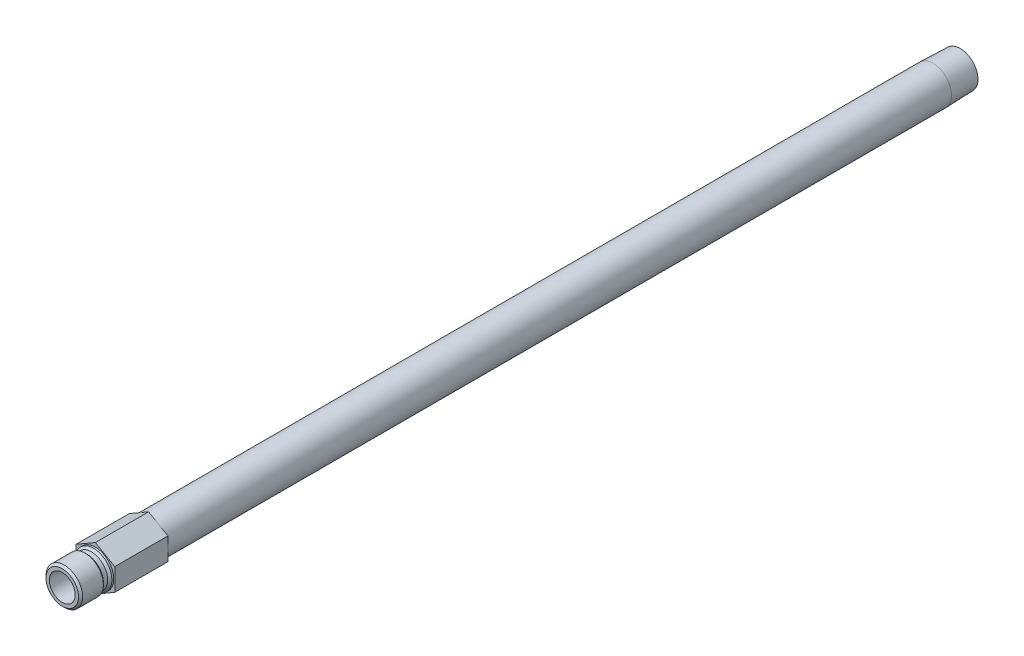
ISO-10303-21;
HEADER;
FILE_DESCRIPTION(('STEP AP214'),'2;1');
FILE_NAME('part.step','',(''),(''),'','','');
FILE_SCHEMA(('AUTOMOTIVE_DESIGN { 1 0 10303 214 1 1 1 1 }'));
ENDSEC;
DATA;
#1=APPLICATION_CONTEXT('core data for automotive mechanical design processes');
#2=APPLICATION_PROTOCOL_DEFINITION('international standard','automotive_design',2000,#1);
#3=PRODUCT_CONTEXT('',#1,'mechanical');
#4=PRODUCT('Part','Part','',(#3));
#5=PRODUCT_RELATED_PRODUCT_CATEGORY('part','',(#4));
#6=PRODUCT_DEFINITION_FORMATION('','',#4);
#7=PRODUCT_DEFINITION_CONTEXT('part definition',#1,'design');
#8=PRODUCT_DEFINITION('design','',#6,#7);
#9=PRODUCT_DEFINITION_SHAPE('','',#8);
#10=(LENGTH_UNIT() NAMED_UNIT(*) SI_UNIT(.MILLI.,.METRE.));
#11=(NAMED_UNIT(*) PLANE_ANGLE_UNIT() SI_UNIT($,.RADIAN.));
#12=(NAMED_UNIT(*) SI_UNIT($,.STERADIAN.) SOLID_ANGLE_UNIT());
#13=UNCERTAINTY_MEASURE_WITH_UNIT(LENGTH_MEASURE(1.E-05),#10,'distance_accuracy_value','');
#14=(GEOMETRIC_REPRESENTATION_CONTEXT(3) GLOBAL_UNCERTAINTY_ASSIGNED_CONTEXT((#13)) GLOBAL_UNIT_ASSIGNED_CONTEXT((#10,
#11,#12)) REPRESENTATION_CONTEXT('',''));
#15=CARTESIAN_POINT('',(0.,0.,0.));
#16=DIRECTION('',(0.,0.,1.));
#17=DIRECTION('',(1.,0.,0.));
#18=AXIS2_PLACEMENT_3D('',#15,#16,#17);
#19=CARTESIAN_POINT('',(0.,0.,0.));
#20=DIRECTION('',(0.,0.,-1.));
#21=DIRECTION('',(0.,1.,0.));
#22=AXIS2_PLACEMENT_3D('',#19,#20,#21);
#23=CYLINDRICAL_SURFACE('',#22,4.7625);
#24=CARTESIAN_POINT('',(0.,0.,0.));
#25=DIRECTION('',(0.,0.,1.));
#26=DIRECTION('',(1.,0.,0.));
#27=AXIS2_PLACEMENT_3D('',#24,#25,#26);
#28=CIRCLE('',#27,4.7625);
#29=CARTESIAN_POINT('',(4.7625,0.,0.));
#30=VERTEX_POINT('',#29);
#31=EDGE_CURVE('E138',#30,#30,#28,.T.);
#32=ORIENTED_EDGE('',*,*,#31,.F.);
#33=EDGE_LOOP('',(#32));
#34=FACE_BOUND('',#33,.T.);
#35=CARTESIAN_POINT('',(0.,0.,12.192));
#36=DIRECTION('',(0.,0.,-1.));
#37=DIRECTION('',(0.,1.,0.));
#38=AXIS2_PLACEMENT_3D('',#35,#36,#37);
#39=CIRCLE('',#38,4.7625);
#40=CARTESIAN_POINT('',(0.,4.7625,12.192));
#41=VERTEX_POINT('',#40);
#42=EDGE_CURVE('E11',#41,#41,#39,.T.);
#43=ORIENTED_EDGE('',*,*,#42,.F.);
#44=EDGE_LOOP('',(#43));
#45=FACE_BOUND('',#44,.T.);
#46=ADVANCED_FACE('F33',(#34,#45),#23,.F.);
#47=CARTESIAN_POINT('',(0.,4.7625,12.192));
#48=DIRECTION('',(0.,0.,1.));
#49=DIRECTION('',(0.,-1.,0.));
#50=AXIS2_PLACEMENT_3D('',#47,#48,#49);
#51=PLANE('',#50);
#52=ORIENTED_EDGE('',*,*,#42,.T.);
#53=EDGE_LOOP('',(#52));
#54=FACE_BOUND('',#53,.T.);
#55=CARTESIAN_POINT('',(0.,0.,12.192));
#56=DIRECTION('',(0.,0.,-1.));
#57=DIRECTION('',(0.,1.,0.));
#58=AXIS2_PLACEMENT_3D('',#55,#56,#57);
#59=CIRCLE('',#58,5.9817);
#60=CARTESIAN_POINT('',(0.,5.9817,12.192));
#61=VERTEX_POINT('',#60);
#62=EDGE_CURVE('E41',#61,#61,#59,.T.);
#63=ORIENTED_EDGE('',*,*,#62,.F.);
#64=EDGE_LOOP('',(#63));
#65=FACE_BOUND('',#64,.T.);
#66=ADVANCED_FACE('F181',(#54,#65),#51,.T.);
#67=CARTESIAN_POINT('',(0.,0.,11.43));
#68=DIRECTION('',(0.,0.,-1.));
#69=DIRECTION('',(0.,1.,0.));
#70=AXIS2_PLACEMENT_3D('',#67,#68,#69);
#71=CONICAL_SURFACE('',#70,6.7437,0.785398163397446);
#72=ORIENTED_EDGE('',*,*,#62,.T.);
#73=EDGE_LOOP('',(#72));
#74=FACE_BOUND('',#73,.T.);
#75=CARTESIAN_POINT('',(0.,0.,11.43));
#76=DIRECTION('',(0.,0.,-1.));
#77=DIRECTION('',(0.,1.,0.));
#78=AXIS2_PLACEMENT_3D('',#75,#76,#77);
#79=CIRCLE('',#78,6.7437);
#80=CARTESIAN_POINT('',(0.,6.7437,11.43));
#81=VERTEX_POINT('',#80);
#82=EDGE_CURVE('E173',#81,#81,#79,.T.);
#83=ORIENTED_EDGE('',*,*,#82,.F.);
#84=EDGE_LOOP('',(#83));
#85=FACE_BOUND('',#84,.T.);
#86=ADVANCED_FACE('F178',(#74,#85),#71,.T.);
#87=CARTESIAN_POINT('',(0.,0.,0.));
#88=DIRECTION('',(0.,0.,-1.));
#89=DIRECTION('',(0.,1.,0.));
#90=AXIS2_PLACEMENT_3D('',#87,#88,#89);
#91=CYLINDRICAL_SURFACE('',#90,6.7437);
#92=ORIENTED_EDGE('',*,*,#82,.T.);
#93=EDGE_LOOP('',(#92));
#94=FACE_BOUND('',#93,.T.);
#95=CARTESIAN_POINT('',(0.,0.,3.81));
#96=DIRECTION('',(0.,0.,-1.));
#97=DIRECTION('',(0.,1.,0.));
#98=AXIS2_PLACEMENT_3D('',#95,#96,#97);
#99=CIRCLE('',#98,6.7437);
#100=CARTESIAN_POINT('',(0.,6.7437,3.81));
#101=VERTEX_POINT('',#100);
#102=EDGE_CURVE('E170',#101,#101,#99,.T.);
#103=ORIENTED_EDGE('',*,*,#102,.F.);
#104=EDGE_LOOP('',(#103));
#105=FACE_BOUND('',#104,.T.);
#106=ADVANCED_FACE('F188',(#94,#105),#91,.T.);
#107=CARTESIAN_POINT('',(0.,0.,3.048));
#108=DIRECTION('',(0.,0.,1.));
#109=DIRECTION('',(0.,-1.,0.));
#110=AXIS2_PLACEMENT_3D('',#107,#108,#109);
#111=CONICAL_SURFACE('',#110,5.9817,0.785398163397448);
#112=ORIENTED_EDGE('',*,*,#102,.T.);
#113=EDGE_LOOP('',(#112));
#114=FACE_BOUND('',#113,.T.);
#115=CARTESIAN_POINT('',(0.,0.,3.048));
#116=DIRECTION('',(0.,0.,-1.));
#117=DIRECTION('',(0.,1.,0.));
#118=AXIS2_PLACEMENT_3D('',#115,#116,#117);
#119=CIRCLE('',#118,5.9817);
#120=CARTESIAN_POINT('',(0.,5.9817,3.048));
#121=VERTEX_POINT('',#120);
#122=EDGE_CURVE('E167',#121,#121,#119,.T.);
#123=ORIENTED_EDGE('',*,*,#122,.F.);
#124=EDGE_LOOP('',(#123));
#125=FACE_BOUND('',#124,.T.);
#126=ADVANCED_FACE('F194',(#114,#125),#111,.T.);
#127=CARTESIAN_POINT('',(0.,0.,0.));
#128=DIRECTION('',(0.,0.,-1.));
#129=DIRECTION('',(0.,1.,0.));
#130=AXIS2_PLACEMENT_3D('',#127,#128,#129);
#131=CYLINDRICAL_SURFACE('',#130,5.9817);
#132=ORIENTED_EDGE('',*,*,#122,.T.);
#133=EDGE_LOOP('',(#132));
#134=FACE_BOUND('',#133,.T.);
#135=CARTESIAN_POINT('',(0.,0.,1.4605));
#136=DIRECTION('',(0.,0.,-1.));
#137=DIRECTION('',(0.,1.,0.));
#138=AXIS2_PLACEMENT_3D('',#135,#136,#137);
#139=CIRCLE('',#138,5.9817);
#140=CARTESIAN_POINT('',(0.,5.9817,1.4605));
#141=VERTEX_POINT('',#140);
#142=EDGE_CURVE('E164',#141,#141,#139,.T.);
#143=ORIENTED_EDGE('',*,*,#142,.F.);
#144=EDGE_LOOP('',(#143));
#145=FACE_BOUND('',#144,.T.);
#146=ADVANCED_FACE('F198',(#134,#145),#131,.T.);
#147=CARTESIAN_POINT('',(0.,0.,0.698499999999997));
#148=DIRECTION('',(0.,0.,-1.));
#149=DIRECTION('',(0.,1.,0.));
#150=AXIS2_PLACEMENT_3D('',#147,#148,#149);
#151=CONICAL_SURFACE('',#150,6.7437,0.785398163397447);
#152=ORIENTED_EDGE('',*,*,#142,.T.);
#153=EDGE_LOOP('',(#152));
#154=FACE_BOUND('',#153,.T.);
#155=CARTESIAN_POINT('',(0.,0.,0.698499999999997));
#156=DIRECTION('',(0.,0.,-1.));
#157=DIRECTION('',(0.,1.,0.));
#158=AXIS2_PLACEMENT_3D('',#155,#156,#157);
#159=CIRCLE('',#158,6.7437);
#160=CARTESIAN_POINT('',(0.,6.7437,0.698499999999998));
#161=VERTEX_POINT('',#160);
#162=EDGE_CURVE('E161',#161,#161,#159,.T.);
#163=ORIENTED_EDGE('',*,*,#162,.F.);
#164=EDGE_LOOP('',(#163));
#165=FACE_BOUND('',#164,.T.);
#166=ADVANCED_FACE('F202',(#154,#165),#151,.T.);
#167=CARTESIAN_POINT('',(0.,0.,0.));
#168=DIRECTION('',(0.,0.,-1.));
#169=DIRECTION('',(0.,1.,0.));
#170=AXIS2_PLACEMENT_3D('',#167,#168,#169);
#171=CYLINDRICAL_SURFACE('',#170,6.7437);
#172=ORIENTED_EDGE('',*,*,#162,.T.);
#173=EDGE_LOOP('',(#172));
#174=FACE_BOUND('',#173,.T.);
#175=CARTESIAN_POINT('',(0.,0.,0.));
#176=DIRECTION('',(0.,0.,-1.));
#177=DIRECTION('',(0.,1.,0.));
#178=AXIS2_PLACEMENT_3D('',#175,#176,#177);
#179=CIRCLE('',#178,6.7437);
#180=CARTESIAN_POINT('',(0.,6.7437,0.));
#181=VERTEX_POINT('',#180);
#182=EDGE_CURVE('E158',#181,#181,#179,.T.);
#183=ORIENTED_EDGE('',*,*,#182,.F.);
#184=EDGE_LOOP('',(#183));
#185=FACE_BOUND('',#184,.T.);
#186=ADVANCED_FACE('F206',(#174,#185),#171,.T.);
#187=CARTESIAN_POINT('',(0.,6.7437,0.));
#188=DIRECTION('',(0.,0.,1.));
#189=DIRECTION('',(0.,-1.,0.));
#190=AXIS2_PLACEMENT_3D('',#187,#188,#189);
#191=PLANE('',#190);
#192=ORIENTED_EDGE('',*,*,#182,.T.);
#193=EDGE_LOOP('',(#192));
#194=FACE_BOUND('',#193,.T.);
#195=DIRECTION('',(-0.866025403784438,-0.5,0.));
#196=VECTOR('',#195,1.);
#197=CARTESIAN_POINT('',(0.,8.21223022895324,0.));
#198=LINE('',#197,#196);
#199=CARTESIAN_POINT('',(0.,8.21223022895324,0.));
#200=VERTEX_POINT('',#199);
#201=CARTESIAN_POINT('',(-7.112,4.10611511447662,0.));
#202=VERTEX_POINT('',#201);
#203=EDGE_CURVE('E120',#200,#202,#198,.T.);
#204=ORIENTED_EDGE('',*,*,#203,.T.);
#205=DIRECTION('',(0.,-1.,0.));
#206=VECTOR('',#205,1.);
#207=CARTESIAN_POINT('',(-7.112,4.10611511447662,0.));
#208=LINE('',#207,#206);
#209=CARTESIAN_POINT('',(-7.112,-4.10611511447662,0.));
#210=VERTEX_POINT('',#209);
#211=EDGE_CURVE('E123',#202,#210,#208,.T.);
#212=ORIENTED_EDGE('',*,*,#211,.T.);
#213=DIRECTION('',(0.866025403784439,-0.5,0.));
#214=VECTOR('',#213,1.);
#215=CARTESIAN_POINT('',(-7.112,-4.10611511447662,0.));
#216=LINE('',#215,#214);
#217=CARTESIAN_POINT('',(0.,-8.21223022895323,0.));
#218=VERTEX_POINT('',#217);
#219=EDGE_CURVE('E127',#210,#218,#216,.T.);
#220=ORIENTED_EDGE('',*,*,#219,.T.);
#221=DIRECTION('',(0.866025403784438,0.5,0.));
#222=VECTOR('',#221,1.);
#223=CARTESIAN_POINT('',(0.,-8.21223022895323,0.));
#224=LINE('',#223,#222);
#225=CARTESIAN_POINT('',(7.112,-4.10611511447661,0.));
#226=VERTEX_POINT('',#225);
#227=EDGE_CURVE('E130',#218,#226,#224,.T.);
#228=ORIENTED_EDGE('',*,*,#227,.T.);
#229=DIRECTION('',(0.,1.,0.));
#230=VECTOR('',#229,1.);
#231=CARTESIAN_POINT('',(7.112,-4.10611511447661,0.));
#232=LINE('',#231,#230);
#233=CARTESIAN_POINT('',(7.112,4.10611511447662,0.));
#234=VERTEX_POINT('',#233);
#235=EDGE_CURVE('E97',#226,#234,#232,.T.);
#236=ORIENTED_EDGE('',*,*,#235,.T.);
#237=DIRECTION('',(-0.866025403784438,0.5,0.));
#238=VECTOR('',#237,1.);
#239=CARTESIAN_POINT('',(7.112,4.10611511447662,0.));
#240=LINE('',#239,#238);
#241=EDGE_CURVE('E133',#234,#200,#240,.T.);
#242=ORIENTED_EDGE('',*,*,#241,.T.);
#243=EDGE_LOOP('',(#204,#212,#220,#228,#236,#242));
#244=FACE_BOUND('',#243,.T.);
#245=ADVANCED_FACE('F210',(#194,#244),#191,.T.);
#246=CARTESIAN_POINT('',(-7.112,4.10611511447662,0.));
#247=DIRECTION('',(0.,0.,1.));
#248=DIRECTION('',(1.,0.,0.));
#249=AXIS2_PLACEMENT_3D('',#246,#247,#248);
#250=PLANE('',#249);
#251=ORIENTED_EDGE('',*,*,#31,.T.);
#252=EDGE_LOOP('',(#251));
#253=FACE_BOUND('',#252,.T.);
#254=CARTESIAN_POINT('',(0.,0.,0.));
#255=DIRECTION('',(0.,0.,1.));
#256=DIRECTION('',(1.,0.,0.));
#257=AXIS2_PLACEMENT_3D('',#254,#255,#256);
#258=CIRCLE('',#257,4.62279999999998);
#259=CARTESIAN_POINT('',(4.62279999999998,0.,0.));
#260=VERTEX_POINT('',#259);
#261=EDGE_CURVE('E124',#260,#260,#258,.T.);
#262=ORIENTED_EDGE('',*,*,#261,.F.);
#263=EDGE_LOOP('',(#262));
#264=FACE_BOUND('',#263,.T.);
#265=ADVANCED_FACE('F214',(#253,#264),#250,.T.);
#266=CARTESIAN_POINT('',(0.,0.,-318.008));
#267=DIRECTION('',(0.,0.,1.));
#268=DIRECTION('',(0.,-1.,0.));
#269=AXIS2_PLACEMENT_3D('',#266,#267,#268);
#270=CONICAL_SURFACE('',#269,6.54447060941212,0.0312396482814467);
#271=CARTESIAN_POINT('',(0.,0.,-307.975));
#272=DIRECTION('',(0.,0.,-1.));
#273=DIRECTION('',(0.,1.,0.));
#274=AXIS2_PLACEMENT_3D('',#271,#272,#273);
#275=CIRCLE('',#274,6.85799999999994);
#276=CARTESIAN_POINT('',(0.,6.858,-307.975));
#277=VERTEX_POINT('',#276);
#278=EDGE_CURVE('E155',#277,#277,#275,.T.);
#279=ORIENTED_EDGE('',*,*,#278,.T.);
#280=EDGE_LOOP('',(#279));
#281=FACE_BOUND('',#280,.T.);
#282=CARTESIAN_POINT('',(0.,0.,-318.008));
#283=DIRECTION('',(0.,0.,-1.));
#284=DIRECTION('',(0.,1.,0.));
#285=AXIS2_PLACEMENT_3D('',#282,#283,#284);
#286=CIRCLE('',#285,6.54447060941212);
#287=CARTESIAN_POINT('',(0.,6.54447060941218,-318.008));
#288=VERTEX_POINT('',#287);
#289=EDGE_CURVE('E152',#288,#288,#286,.T.);
#290=ORIENTED_EDGE('',*,*,#289,.F.);
#291=EDGE_LOOP('',(#290));
#292=FACE_BOUND('',#291,.T.);
#293=ADVANCED_FACE('F220',(#281,#292),#270,.T.);
#294=CARTESIAN_POINT('',(0.,0.,0.));
#295=DIRECTION('',(0.,0.,-1.));
#296=DIRECTION('',(0.,1.,0.));
#297=AXIS2_PLACEMENT_3D('',#294,#295,#296);
#298=CYLINDRICAL_SURFACE('',#297,6.85799999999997);
#299=ORIENTED_EDGE('',*,*,#278,.F.);
#300=EDGE_LOOP('',(#299));
#301=FACE_BOUND('',#300,.T.);
#302=CARTESIAN_POINT('',(0.,0.,-19.558));
#303=DIRECTION('',(0.,0.,1.));
#304=DIRECTION('',(1.,0.,0.));
#305=AXIS2_PLACEMENT_3D('',#302,#303,#304);
#306=CIRCLE('',#305,6.85799999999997);
#307=CARTESIAN_POINT('',(6.85799999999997,0.,-19.558));
#308=VERTEX_POINT('',#307);
#309=EDGE_CURVE('E146',#308,#308,#306,.F.);
#310=ORIENTED_EDGE('',*,*,#309,.T.);
#311=EDGE_LOOP('',(#310));
#312=FACE_BOUND('',#311,.T.);
#313=ADVANCED_FACE('F216',(#301,#312),#298,.T.);
#314=CARTESIAN_POINT('',(0.,6.54447060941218,-318.008));
#315=DIRECTION('',(0.,0.,-1.));
#316=DIRECTION('',(0.,1.,0.));
#317=AXIS2_PLACEMENT_3D('',#314,#315,#316);
#318=PLANE('',#317);
#319=ORIENTED_EDGE('',*,*,#289,.T.);
#320=EDGE_LOOP('',(#319));
#321=FACE_BOUND('',#320,.T.);
#322=CARTESIAN_POINT('',(0.,0.,-318.008));
#323=DIRECTION('',(0.,0.,-1.));
#324=DIRECTION('',(0.,1.,0.));
#325=AXIS2_PLACEMENT_3D('',#322,#323,#324);
#326=CIRCLE('',#325,4.62279999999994);
#327=CARTESIAN_POINT('',(0.,4.6228,-318.008));
#328=VERTEX_POINT('',#327);
#329=EDGE_CURVE('E149',#328,#328,#326,.T.);
#330=ORIENTED_EDGE('',*,*,#329,.F.);
#331=EDGE_LOOP('',(#330));
#332=FACE_BOUND('',#331,.T.);
#333=ADVANCED_FACE('F219',(#321,#332),#318,.T.);
#334=CARTESIAN_POINT('',(0.,0.,0.));
#335=DIRECTION('',(0.,0.,-1.));
#336=DIRECTION('',(0.,1.,0.));
#337=AXIS2_PLACEMENT_3D('',#334,#335,#336);
#338=CYLINDRICAL_SURFACE('',#337,4.62279999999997);
#339=ORIENTED_EDGE('',*,*,#261,.T.);
#340=EDGE_LOOP('',(#339));
#341=FACE_BOUND('',#340,.T.);
#342=ORIENTED_EDGE('',*,*,#329,.T.);
#343=EDGE_LOOP('',(#342));
#344=FACE_BOUND('',#343,.T.);
#345=ADVANCED_FACE('F227',(#341,#344),#338,.F.);
#346=CARTESIAN_POINT('',(0.,8.21223022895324,-19.558));
#347=DIRECTION('',(-0.5,0.866025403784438,0.));
#348=DIRECTION('',(-0.866025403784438,-0.5,0.));
#349=AXIS2_PLACEMENT_3D('',#346,#347,#348);
#350=PLANE('',#349);
#351=ORIENTED_EDGE('',*,*,#203,.F.);
#352=DIRECTION('',(0.,0.,1.));
#353=VECTOR('',#352,1.);
#354=CARTESIAN_POINT('',(0.,8.21223022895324,-19.558));
#355=LINE('',#354,#353);
#356=CARTESIAN_POINT('',(0.,8.21223022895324,-19.558));
#357=VERTEX_POINT('',#356);
#358=EDGE_CURVE('E49',#357,#200,#355,.T.);
#359=ORIENTED_EDGE('',*,*,#358,.F.);
#360=DIRECTION('',(-0.866025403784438,-0.5,0.));
#361=VECTOR('',#360,1.);
#362=CARTESIAN_POINT('',(0.,8.21223022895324,-19.558));
#363=LINE('',#362,#361);
#364=CARTESIAN_POINT('',(-7.112,4.10611511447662,-19.558));
#365=VERTEX_POINT('',#364);
#366=EDGE_CURVE('E136',#357,#365,#363,.T.);
#367=ORIENTED_EDGE('',*,*,#366,.T.);
#368=DIRECTION('',(0.,0.,1.));
#369=VECTOR('',#368,1.);
#370=CARTESIAN_POINT('',(-7.112,4.10611511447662,-19.558));
#371=LINE('',#370,#369);
#372=EDGE_CURVE('E84',#365,#202,#371,.T.);
#373=ORIENTED_EDGE('',*,*,#372,.T.);
#374=EDGE_LOOP('',(#351,#359,#367,#373));
#375=FACE_BOUND('',#374,.T.);
#376=ADVANCED_FACE('F231',(#375),#350,.T.);
#377=CARTESIAN_POINT('',(7.112,4.10611511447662,-19.558));
#378=DIRECTION('',(0.5,0.866025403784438,0.));
#379=DIRECTION('',(-0.866025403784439,0.5,0.));
#380=AXIS2_PLACEMENT_3D('',#377,#378,#379);
#381=PLANE('',#380);
#382=ORIENTED_EDGE('',*,*,#241,.F.);
#383=DIRECTION('',(0.,0.,1.));
#384=VECTOR('',#383,1.);
#385=CARTESIAN_POINT('',(7.112,4.10611511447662,-19.558));
#386=LINE('',#385,#384);
#387=CARTESIAN_POINT('',(7.112,4.10611511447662,-19.558));
#388=VERTEX_POINT('',#387);
#389=EDGE_CURVE('E72',#388,#234,#386,.T.);
#390=ORIENTED_EDGE('',*,*,#389,.F.);
#391=DIRECTION('',(-0.866025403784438,0.5,0.));
#392=VECTOR('',#391,1.);
#393=CARTESIAN_POINT('',(7.112,4.10611511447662,-19.558));
#394=LINE('',#393,#392);
#395=EDGE_CURVE('E110',#388,#357,#394,.T.);
#396=ORIENTED_EDGE('',*,*,#395,.T.);
#397=ORIENTED_EDGE('',*,*,#358,.T.);
#398=EDGE_LOOP('',(#382,#390,#396,#397));
#399=FACE_BOUND('',#398,.T.);
#400=ADVANCED_FACE('F235',(#399),#381,.T.);
#401=CARTESIAN_POINT('',(7.112,-4.10611511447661,-19.558));
#402=DIRECTION('',(1.,0.,0.));
#403=DIRECTION('',(0.,1.,0.));
#404=AXIS2_PLACEMENT_3D('',#401,#402,#403);
#405=PLANE('',#404);
#406=ORIENTED_EDGE('',*,*,#235,.F.);
#407=DIRECTION('',(0.,0.,1.));
#408=VECTOR('',#407,1.);
#409=CARTESIAN_POINT('',(7.112,-4.10611511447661,-19.558));
#410=LINE('',#409,#408);
#411=CARTESIAN_POINT('',(7.112,-4.10611511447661,-19.558));
#412=VERTEX_POINT('',#411);
#413=EDGE_CURVE('E92',#412,#226,#410,.T.);
#414=ORIENTED_EDGE('',*,*,#413,.F.);
#415=DIRECTION('',(0.,1.,0.));
#416=VECTOR('',#415,1.);
#417=CARTESIAN_POINT('',(7.112,-4.10611511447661,-19.558));
#418=LINE('',#417,#416);
#419=EDGE_CURVE('E95',#412,#388,#418,.T.);
#420=ORIENTED_EDGE('',*,*,#419,.T.);
#421=ORIENTED_EDGE('',*,*,#389,.T.);
#422=EDGE_LOOP('',(#406,#414,#420,#421));
#423=FACE_BOUND('',#422,.T.);
#424=ADVANCED_FACE('F94',(#423),#405,.T.);
#425=CARTESIAN_POINT('',(0.,-8.21223022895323,-19.558));
#426=DIRECTION('',(0.5,-0.866025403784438,0.));
#427=DIRECTION('',(0.866025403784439,0.5,0.));
#428=AXIS2_PLACEMENT_3D('',#425,#426,#427);
#429=PLANE('',#428);
#430=ORIENTED_EDGE('',*,*,#227,.F.);
#431=DIRECTION('',(0.,0.,1.));
#432=VECTOR('',#431,1.);
#433=CARTESIAN_POINT('',(0.,-8.21223022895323,-19.558));
#434=LINE('',#433,#432);
#435=CARTESIAN_POINT('',(0.,-8.21223022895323,-19.558));
#436=VERTEX_POINT('',#435);
#437=EDGE_CURVE('E102',#436,#218,#434,.T.);
#438=ORIENTED_EDGE('',*,*,#437,.F.);
#439=DIRECTION('',(0.866025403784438,0.5,0.));
#440=VECTOR('',#439,1.);
#441=CARTESIAN_POINT('',(0.,-8.21223022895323,-19.558));
#442=LINE('',#441,#440);
#443=EDGE_CURVE('E108',#436,#412,#442,.T.);
#444=ORIENTED_EDGE('',*,*,#443,.T.);
#445=ORIENTED_EDGE('',*,*,#413,.T.);
#446=EDGE_LOOP('',(#430,#438,#444,#445));
#447=FACE_BOUND('',#446,.T.);
#448=ADVANCED_FACE('F112',(#447),#429,.T.);
#449=CARTESIAN_POINT('',(-7.112,-4.10611511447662,-19.558));
#450=DIRECTION('',(-0.5,-0.866025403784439,0.));
#451=DIRECTION('',(0.866025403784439,-0.5,0.));
#452=AXIS2_PLACEMENT_3D('',#449,#450,#451);
#453=PLANE('',#452);
#454=ORIENTED_EDGE('',*,*,#219,.F.);
#455=DIRECTION('',(0.,0.,1.));
#456=VECTOR('',#455,1.);
#457=CARTESIAN_POINT('',(-7.112,-4.10611511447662,-19.558));
#458=LINE('',#457,#456);
#459=CARTESIAN_POINT('',(-7.112,-4.10611511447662,-19.558));
#460=VERTEX_POINT('',#459);
#461=EDGE_CURVE('E141',#460,#210,#458,.T.);
#462=ORIENTED_EDGE('',*,*,#461,.F.);
#463=DIRECTION('',(0.866025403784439,-0.5,0.));
#464=VECTOR('',#463,1.);
#465=CARTESIAN_POINT('',(-7.112,-4.10611511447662,-19.558));
#466=LINE('',#465,#464);
#467=EDGE_CURVE('E113',#460,#436,#466,.T.);
#468=ORIENTED_EDGE('',*,*,#467,.T.);
#469=ORIENTED_EDGE('',*,*,#437,.T.);
#470=EDGE_LOOP('',(#454,#462,#468,#469));
#471=FACE_BOUND('',#470,.T.);
#472=ADVANCED_FACE('F239',(#471),#453,.T.);
#473=CARTESIAN_POINT('',(-7.112,4.10611511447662,-19.558));
#474=DIRECTION('',(-1.,0.,0.));
#475=DIRECTION('',(0.,-1.,0.));
#476=AXIS2_PLACEMENT_3D('',#473,#474,#475);
#477=PLANE('',#476);
#478=ORIENTED_EDGE('',*,*,#211,.F.);
#479=ORIENTED_EDGE('',*,*,#372,.F.);
#480=DIRECTION('',(0.,-1.,0.));
#481=VECTOR('',#480,1.);
#482=CARTESIAN_POINT('',(-7.112,4.10611511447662,-19.558));
#483=LINE('',#482,#481);
#484=EDGE_CURVE('E115',#365,#460,#483,.T.);
#485=ORIENTED_EDGE('',*,*,#484,.T.);
#486=ORIENTED_EDGE('',*,*,#461,.T.);
#487=EDGE_LOOP('',(#478,#479,#485,#486));
#488=FACE_BOUND('',#487,.T.);
#489=ADVANCED_FACE('F236',(#488),#477,.T.);
#490=CARTESIAN_POINT('',(-7.112,4.10611511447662,-19.558));
#491=DIRECTION('',(0.,0.,1.));
#492=DIRECTION('',(1.,0.,0.));
#493=AXIS2_PLACEMENT_3D('',#490,#491,#492);
#494=PLANE('',#493);
#495=ORIENTED_EDGE('',*,*,#309,.F.);
#496=EDGE_LOOP('',(#495));
#497=FACE_BOUND('',#496,.T.);
#498=ORIENTED_EDGE('',*,*,#366,.F.);
#499=ORIENTED_EDGE('',*,*,#395,.F.);
#500=ORIENTED_EDGE('',*,*,#419,.F.);
#501=ORIENTED_EDGE('',*,*,#443,.F.);
#502=ORIENTED_EDGE('',*,*,#467,.F.);
#503=ORIENTED_EDGE('',*,*,#484,.F.);
#504=EDGE_LOOP('',(#498,#499,#500,#501,#502,#503));
#505=FACE_BOUND('',#504,.T.);
#506=ADVANCED_FACE('F106',(#497,#505),#494,.F.);
#507=CLOSED_SHELL('',(#46,#66,#86,#106,#126,#146,#166,#186,#245,#265,#293,#313,#333,#345,#376,
#400,#424,#448,#472,#489,#506));
#508=MANIFOLD_SOLID_BREP('B2',#507);
#509=ADVANCED_BREP_SHAPE_REPRESENTATION('',(#18,#508),#14);
#510=SHAPE_DEFINITION_REPRESENTATION(#9,#509);
ENDSEC;
END-ISO-10303-21;
